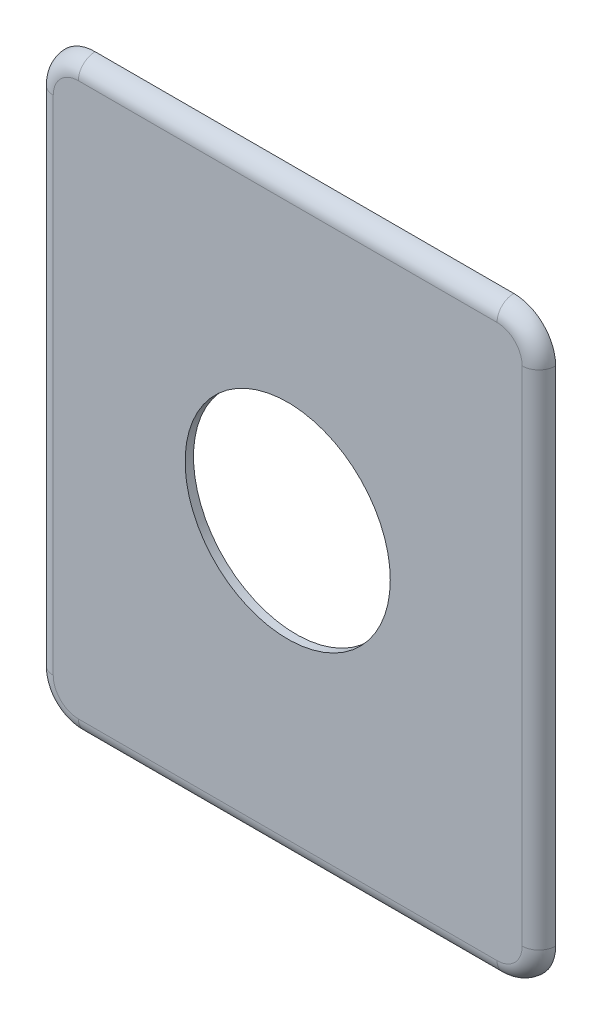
ISO-10303-21;
HEADER;
FILE_DESCRIPTION(('STEP AP214'),'2;1');
FILE_NAME('part.step','',(''),(''),'','','');
FILE_SCHEMA(('AUTOMOTIVE_DESIGN { 1 0 10303 214 1 1 1 1 }'));
ENDSEC;
DATA;
#1=APPLICATION_CONTEXT('core data for automotive mechanical design processes');
#2=APPLICATION_PROTOCOL_DEFINITION('international standard','automotive_design',2000,#1);
#3=PRODUCT_CONTEXT('',#1,'mechanical');
#4=PRODUCT('Part','Part','',(#3));
#5=PRODUCT_RELATED_PRODUCT_CATEGORY('part','',(#4));
#6=PRODUCT_DEFINITION_FORMATION('','',#4);
#7=PRODUCT_DEFINITION_CONTEXT('part definition',#1,'design');
#8=PRODUCT_DEFINITION('design','',#6,#7);
#9=PRODUCT_DEFINITION_SHAPE('','',#8);
#10=(LENGTH_UNIT() NAMED_UNIT(*) SI_UNIT(.MILLI.,.METRE.));
#11=(NAMED_UNIT(*) PLANE_ANGLE_UNIT() SI_UNIT($,.RADIAN.));
#12=(NAMED_UNIT(*) SI_UNIT($,.STERADIAN.) SOLID_ANGLE_UNIT());
#13=UNCERTAINTY_MEASURE_WITH_UNIT(LENGTH_MEASURE(1.E-05),#10,'distance_accuracy_value','');
#14=(GEOMETRIC_REPRESENTATION_CONTEXT(3) GLOBAL_UNCERTAINTY_ASSIGNED_CONTEXT((#13)) GLOBAL_UNIT_ASSIGNED_CONTEXT((#10,
#11,#12)) REPRESENTATION_CONTEXT('',''));
#15=CARTESIAN_POINT('',(0.,0.,0.));
#16=DIRECTION('',(0.,0.,1.));
#17=DIRECTION('',(1.,0.,0.));
#18=AXIS2_PLACEMENT_3D('',#15,#16,#17);
#19=CARTESIAN_POINT('',(-25.,-30.,2.));
#20=DIRECTION('',(0.,0.,-1.));
#21=DIRECTION('',(-1.,0.,0.));
#22=AXIS2_PLACEMENT_3D('',#19,#20,#21);
#23=PLANE('',#22);
#24=DIRECTION('',(-1.,0.,0.));
#25=VECTOR('',#24,1.);
#26=CARTESIAN_POINT('',(-25.,33.,2.));
#27=LINE('',#26,#25);
#28=CARTESIAN_POINT('',(25.,33.,2.));
#29=VERTEX_POINT('',#28);
#30=CARTESIAN_POINT('',(-25.,33.,2.));
#31=VERTEX_POINT('',#30);
#32=EDGE_CURVE('E50',#29,#31,#27,.T.);
#33=ORIENTED_EDGE('',*,*,#32,.T.);
#34=CARTESIAN_POINT('',(-25.,30.,2.));
#35=DIRECTION('',(0.,0.,-1.));
#36=DIRECTION('',(-1.,0.,0.));
#37=AXIS2_PLACEMENT_3D('',#34,#35,#36);
#38=CIRCLE('',#37,3.);
#39=CARTESIAN_POINT('',(-28.,30.,2.));
#40=VERTEX_POINT('',#39);
#41=EDGE_CURVE('E11',#31,#40,#38,.F.);
#42=ORIENTED_EDGE('',*,*,#41,.T.);
#43=DIRECTION('',(0.,-1.,0.));
#44=VECTOR('',#43,1.);
#45=CARTESIAN_POINT('',(-28.,-30.,2.));
#46=LINE('',#45,#44);
#47=CARTESIAN_POINT('',(-28.,-30.,2.));
#48=VERTEX_POINT('',#47);
#49=EDGE_CURVE('E153',#40,#48,#46,.T.);
#50=ORIENTED_EDGE('',*,*,#49,.T.);
#51=CARTESIAN_POINT('',(-25.,-30.,2.));
#52=DIRECTION('',(0.,0.,-1.));
#53=DIRECTION('',(-1.,0.,0.));
#54=AXIS2_PLACEMENT_3D('',#51,#52,#53);
#55=CIRCLE('',#54,3.);
#56=CARTESIAN_POINT('',(-25.,-33.,2.));
#57=VERTEX_POINT('',#56);
#58=EDGE_CURVE('E155',#48,#57,#55,.F.);
#59=ORIENTED_EDGE('',*,*,#58,.T.);
#60=DIRECTION('',(1.,0.,0.));
#61=VECTOR('',#60,1.);
#62=CARTESIAN_POINT('',(-25.,-33.,2.));
#63=LINE('',#62,#61);
#64=CARTESIAN_POINT('',(25.,-33.,2.));
#65=VERTEX_POINT('',#64);
#66=EDGE_CURVE('E121',#57,#65,#63,.T.);
#67=ORIENTED_EDGE('',*,*,#66,.T.);
#68=CARTESIAN_POINT('',(25.,-30.,2.));
#69=DIRECTION('',(0.,0.,-1.));
#70=DIRECTION('',(-1.,0.,0.));
#71=AXIS2_PLACEMENT_3D('',#68,#69,#70);
#72=CIRCLE('',#71,3.);
#73=CARTESIAN_POINT('',(28.,-30.,2.));
#74=VERTEX_POINT('',#73);
#75=EDGE_CURVE('E158',#65,#74,#72,.F.);
#76=ORIENTED_EDGE('',*,*,#75,.T.);
#77=DIRECTION('',(0.,1.,0.));
#78=VECTOR('',#77,1.);
#79=CARTESIAN_POINT('',(28.,-30.,2.));
#80=LINE('',#79,#78);
#81=CARTESIAN_POINT('',(28.,30.,2.));
#82=VERTEX_POINT('',#81);
#83=EDGE_CURVE('E160',#74,#82,#80,.T.);
#84=ORIENTED_EDGE('',*,*,#83,.T.);
#85=CARTESIAN_POINT('',(25.,30.,2.));
#86=DIRECTION('',(0.,0.,-1.));
#87=DIRECTION('',(-1.,0.,0.));
#88=AXIS2_PLACEMENT_3D('',#85,#86,#87);
#89=CIRCLE('',#88,3.);
#90=EDGE_CURVE('E61',#82,#29,#89,.F.);
#91=ORIENTED_EDGE('',*,*,#90,.T.);
#92=EDGE_LOOP('',(#33,#42,#50,#59,#67,#76,#84,#91));
#93=FACE_BOUND('',#92,.T.);
#94=CARTESIAN_POINT('',(0.,0.,2.));
#95=DIRECTION('',(0.,0.,1.));
#96=DIRECTION('',(1.,0.,0.));
#97=AXIS2_PLACEMENT_3D('',#94,#95,#96);
#98=CIRCLE('',#97,12.25);
#99=CARTESIAN_POINT('',(12.25,0.,2.));
#100=VERTEX_POINT('',#99);
#101=EDGE_CURVE('E174',#100,#100,#98,.T.);
#102=ORIENTED_EDGE('',*,*,#101,.F.);
#103=EDGE_LOOP('',(#102));
#104=FACE_BOUND('',#103,.T.);
#105=ADVANCED_FACE('F41',(#93,#104),#23,.F.);
#106=CARTESIAN_POINT('',(-25.,-30.,0.));
#107=DIRECTION('',(0.,0.,-1.));
#108=DIRECTION('',(-1.,0.,0.));
#109=AXIS2_PLACEMENT_3D('',#106,#107,#108);
#110=PLANE('',#109);
#111=CARTESIAN_POINT('',(0.,0.,0.));
#112=DIRECTION('',(0.,0.,1.));
#113=DIRECTION('',(1.,0.,0.));
#114=AXIS2_PLACEMENT_3D('',#111,#112,#113);
#115=CIRCLE('',#114,14.25);
#116=CARTESIAN_POINT('',(14.25,0.,0.));
#117=VERTEX_POINT('',#116);
#118=EDGE_CURVE('E131',#117,#117,#115,.T.);
#119=ORIENTED_EDGE('',*,*,#118,.T.);
#120=EDGE_LOOP('',(#119));
#121=FACE_BOUND('',#120,.T.);
#122=CARTESIAN_POINT('',(-25.,-30.,0.));
#123=DIRECTION('',(0.,0.,1.));
#124=DIRECTION('',(-1.,0.,0.));
#125=AXIS2_PLACEMENT_3D('',#122,#123,#124);
#126=CIRCLE('',#125,5.);
#127=CARTESIAN_POINT('',(-30.,-30.,0.));
#128=VERTEX_POINT('',#127);
#129=CARTESIAN_POINT('',(-25.,-35.,0.));
#130=VERTEX_POINT('',#129);
#131=EDGE_CURVE('E109',#128,#130,#126,.T.);
#132=ORIENTED_EDGE('',*,*,#131,.F.);
#133=DIRECTION('',(0.,-1.,0.));
#134=VECTOR('',#133,1.);
#135=CARTESIAN_POINT('',(-30.,-30.,0.));
#136=LINE('',#135,#134);
#137=CARTESIAN_POINT('',(-30.,30.,0.));
#138=VERTEX_POINT('',#137);
#139=EDGE_CURVE('E151',#138,#128,#136,.T.);
#140=ORIENTED_EDGE('',*,*,#139,.F.);
#141=CARTESIAN_POINT('',(-25.,30.,0.));
#142=DIRECTION('',(0.,0.,1.));
#143=DIRECTION('',(-1.,0.,0.));
#144=AXIS2_PLACEMENT_3D('',#141,#142,#143);
#145=CIRCLE('',#144,5.);
#146=CARTESIAN_POINT('',(-25.,35.,0.));
#147=VERTEX_POINT('',#146);
#148=EDGE_CURVE('E148',#147,#138,#145,.T.);
#149=ORIENTED_EDGE('',*,*,#148,.F.);
#150=DIRECTION('',(-1.,0.,0.));
#151=VECTOR('',#150,1.);
#152=CARTESIAN_POINT('',(-25.,35.,0.));
#153=LINE('',#152,#151);
#154=CARTESIAN_POINT('',(25.,35.,0.));
#155=VERTEX_POINT('',#154);
#156=EDGE_CURVE('E145',#155,#147,#153,.T.);
#157=ORIENTED_EDGE('',*,*,#156,.F.);
#158=CARTESIAN_POINT('',(25.,30.,0.));
#159=DIRECTION('',(0.,0.,1.));
#160=DIRECTION('',(-1.,0.,0.));
#161=AXIS2_PLACEMENT_3D('',#158,#159,#160);
#162=CIRCLE('',#161,5.);
#163=CARTESIAN_POINT('',(30.,30.,0.));
#164=VERTEX_POINT('',#163);
#165=EDGE_CURVE('E142',#164,#155,#162,.T.);
#166=ORIENTED_EDGE('',*,*,#165,.F.);
#167=DIRECTION('',(0.,1.,0.));
#168=VECTOR('',#167,1.);
#169=CARTESIAN_POINT('',(30.,-30.,0.));
#170=LINE('',#169,#168);
#171=CARTESIAN_POINT('',(30.,-30.,0.));
#172=VERTEX_POINT('',#171);
#173=EDGE_CURVE('E139',#172,#164,#170,.T.);
#174=ORIENTED_EDGE('',*,*,#173,.F.);
#175=CARTESIAN_POINT('',(25.,-30.,0.));
#176=DIRECTION('',(0.,0.,1.));
#177=DIRECTION('',(1.,0.,0.));
#178=AXIS2_PLACEMENT_3D('',#175,#176,#177);
#179=CIRCLE('',#178,5.);
#180=CARTESIAN_POINT('',(25.,-35.,0.));
#181=VERTEX_POINT('',#180);
#182=EDGE_CURVE('E112',#181,#172,#179,.T.);
#183=ORIENTED_EDGE('',*,*,#182,.F.);
#184=DIRECTION('',(1.,0.,0.));
#185=VECTOR('',#184,1.);
#186=CARTESIAN_POINT('',(-25.,-35.,0.));
#187=LINE('',#186,#185);
#188=EDGE_CURVE('E105',#130,#181,#187,.T.);
#189=ORIENTED_EDGE('',*,*,#188,.F.);
#190=EDGE_LOOP('',(#132,#140,#149,#157,#166,#174,#183,#189));
#191=FACE_BOUND('',#190,.T.);
#192=ADVANCED_FACE('F107',(#121,#191),#110,.T.);
#193=CARTESIAN_POINT('',(0.,0.,2.));
#194=DIRECTION('',(0.,0.,1.));
#195=DIRECTION('',(1.,0.,0.));
#196=AXIS2_PLACEMENT_3D('',#193,#194,#195);
#197=CYLINDRICAL_SURFACE('',#196,14.25);
#198=ORIENTED_EDGE('',*,*,#118,.F.);
#199=EDGE_LOOP('',(#198));
#200=FACE_BOUND('',#199,.T.);
#201=CARTESIAN_POINT('',(0.,0.,1.));
#202=DIRECTION('',(0.,0.,1.));
#203=DIRECTION('',(1.,0.,0.));
#204=AXIS2_PLACEMENT_3D('',#201,#202,#203);
#205=CIRCLE('',#204,14.25);
#206=CARTESIAN_POINT('',(14.25,0.,1.));
#207=VERTEX_POINT('',#206);
#208=EDGE_CURVE('E134',#207,#207,#205,.T.);
#209=ORIENTED_EDGE('',*,*,#208,.T.);
#210=EDGE_LOOP('',(#209));
#211=FACE_BOUND('',#210,.T.);
#212=ADVANCED_FACE('F188',(#200,#211),#197,.F.);
#213=CARTESIAN_POINT('',(12.25,0.,1.));
#214=DIRECTION('',(0.,0.,1.));
#215=DIRECTION('',(1.,0.,0.));
#216=AXIS2_PLACEMENT_3D('',#213,#214,#215);
#217=PLANE('',#216);
#218=ORIENTED_EDGE('',*,*,#208,.F.);
#219=EDGE_LOOP('',(#218));
#220=FACE_BOUND('',#219,.T.);
#221=CARTESIAN_POINT('',(0.,0.,1.));
#222=DIRECTION('',(0.,0.,1.));
#223=DIRECTION('',(1.,0.,0.));
#224=AXIS2_PLACEMENT_3D('',#221,#222,#223);
#225=CIRCLE('',#224,12.25);
#226=CARTESIAN_POINT('',(12.25,0.,1.));
#227=VERTEX_POINT('',#226);
#228=EDGE_CURVE('E179',#227,#227,#225,.T.);
#229=ORIENTED_EDGE('',*,*,#228,.T.);
#230=EDGE_LOOP('',(#229));
#231=FACE_BOUND('',#230,.T.);
#232=ADVANCED_FACE('F190',(#220,#231),#217,.F.);
#233=CARTESIAN_POINT('',(0.,0.,2.));
#234=DIRECTION('',(0.,0.,1.));
#235=DIRECTION('',(1.,0.,0.));
#236=AXIS2_PLACEMENT_3D('',#233,#234,#235);
#237=CYLINDRICAL_SURFACE('',#236,12.25);
#238=ORIENTED_EDGE('',*,*,#228,.F.);
#239=EDGE_LOOP('',(#238));
#240=FACE_BOUND('',#239,.T.);
#241=ORIENTED_EDGE('',*,*,#101,.T.);
#242=EDGE_LOOP('',(#241));
#243=FACE_BOUND('',#242,.T.);
#244=ADVANCED_FACE('F193',(#240,#243),#237,.F.);
#245=CARTESIAN_POINT('',(25.,-30.,0.));
#246=DIRECTION('',(0.,0.,-1.));
#247=DIRECTION('',(-1.,0.,0.));
#248=AXIS2_PLACEMENT_3D('',#245,#246,#247);
#249=TOROIDAL_SURFACE('',#248,3.,2.);
#250=CARTESIAN_POINT('',(25.,-33.,0.));
#251=DIRECTION('',(-1.,0.,0.));
#252=DIRECTION('',(0.,0.,1.));
#253=AXIS2_PLACEMENT_3D('',#250,#251,#252);
#254=CIRCLE('',#253,2.);
#255=EDGE_CURVE('E172',#181,#65,#254,.T.);
#256=ORIENTED_EDGE('',*,*,#255,.F.);
#257=ORIENTED_EDGE('',*,*,#182,.T.);
#258=CARTESIAN_POINT('',(28.,-30.,0.));
#259=DIRECTION('',(0.,1.,0.));
#260=DIRECTION('',(0.,0.,1.));
#261=AXIS2_PLACEMENT_3D('',#258,#259,#260);
#262=CIRCLE('',#261,2.);
#263=EDGE_CURVE('E45',#74,#172,#262,.T.);
#264=ORIENTED_EDGE('',*,*,#263,.F.);
#265=ORIENTED_EDGE('',*,*,#75,.F.);
#266=EDGE_LOOP('',(#256,#257,#264,#265));
#267=FACE_BOUND('',#266,.T.);
#268=ADVANCED_FACE('F43',(#267),#249,.T.);
#269=CARTESIAN_POINT('',(28.,-30.,0.));
#270=DIRECTION('',(0.,1.,0.));
#271=DIRECTION('',(0.,0.,1.));
#272=AXIS2_PLACEMENT_3D('',#269,#270,#271);
#273=CYLINDRICAL_SURFACE('',#272,2.);
#274=ORIENTED_EDGE('',*,*,#263,.T.);
#275=ORIENTED_EDGE('',*,*,#173,.T.);
#276=CARTESIAN_POINT('',(28.,30.,0.));
#277=DIRECTION('',(0.,1.,0.));
#278=DIRECTION('',(0.,0.,1.));
#279=AXIS2_PLACEMENT_3D('',#276,#277,#278);
#280=CIRCLE('',#279,2.);
#281=EDGE_CURVE('E124',#82,#164,#280,.T.);
#282=ORIENTED_EDGE('',*,*,#281,.F.);
#283=ORIENTED_EDGE('',*,*,#83,.F.);
#284=EDGE_LOOP('',(#274,#275,#282,#283));
#285=FACE_BOUND('',#284,.T.);
#286=ADVANCED_FACE('F203',(#285),#273,.T.);
#287=CARTESIAN_POINT('',(-25.,-33.,0.));
#288=DIRECTION('',(1.,0.,0.));
#289=DIRECTION('',(0.,0.,-1.));
#290=AXIS2_PLACEMENT_3D('',#287,#288,#289);
#291=CYLINDRICAL_SURFACE('',#290,2.);
#292=ORIENTED_EDGE('',*,*,#255,.T.);
#293=ORIENTED_EDGE('',*,*,#66,.F.);
#294=CARTESIAN_POINT('',(-25.,-33.,0.));
#295=DIRECTION('',(-1.,0.,0.));
#296=DIRECTION('',(0.,0.,1.));
#297=AXIS2_PLACEMENT_3D('',#294,#295,#296);
#298=CIRCLE('',#297,2.);
#299=EDGE_CURVE('E119',#130,#57,#298,.T.);
#300=ORIENTED_EDGE('',*,*,#299,.F.);
#301=ORIENTED_EDGE('',*,*,#188,.T.);
#302=EDGE_LOOP('',(#292,#293,#300,#301));
#303=FACE_BOUND('',#302,.T.);
#304=ADVANCED_FACE('F120',(#303),#291,.T.);
#305=CARTESIAN_POINT('',(25.,30.,0.));
#306=DIRECTION('',(0.,0.,-1.));
#307=DIRECTION('',(-1.,0.,0.));
#308=AXIS2_PLACEMENT_3D('',#305,#306,#307);
#309=TOROIDAL_SURFACE('',#308,3.,2.);
#310=ORIENTED_EDGE('',*,*,#281,.T.);
#311=ORIENTED_EDGE('',*,*,#165,.T.);
#312=CARTESIAN_POINT('',(25.,33.,0.));
#313=DIRECTION('',(-1.,0.,0.));
#314=DIRECTION('',(0.,0.,1.));
#315=AXIS2_PLACEMENT_3D('',#312,#313,#314);
#316=CIRCLE('',#315,2.);
#317=EDGE_CURVE('E125',#29,#155,#316,.T.);
#318=ORIENTED_EDGE('',*,*,#317,.F.);
#319=ORIENTED_EDGE('',*,*,#90,.F.);
#320=EDGE_LOOP('',(#310,#311,#318,#319));
#321=FACE_BOUND('',#320,.T.);
#322=ADVANCED_FACE('F228',(#321),#309,.T.);
#323=CARTESIAN_POINT('',(-25.,-30.,0.));
#324=DIRECTION('',(0.,0.,-1.));
#325=DIRECTION('',(-1.,0.,0.));
#326=AXIS2_PLACEMENT_3D('',#323,#324,#325);
#327=TOROIDAL_SURFACE('',#326,3.,2.);
#328=ORIENTED_EDGE('',*,*,#299,.T.);
#329=ORIENTED_EDGE('',*,*,#58,.F.);
#330=CARTESIAN_POINT('',(-28.,-30.,0.));
#331=DIRECTION('',(0.,1.,0.));
#332=DIRECTION('',(0.,0.,1.));
#333=AXIS2_PLACEMENT_3D('',#330,#331,#332);
#334=CIRCLE('',#333,2.);
#335=EDGE_CURVE('E129',#128,#48,#334,.T.);
#336=ORIENTED_EDGE('',*,*,#335,.F.);
#337=ORIENTED_EDGE('',*,*,#131,.T.);
#338=EDGE_LOOP('',(#328,#329,#336,#337));
#339=FACE_BOUND('',#338,.T.);
#340=ADVANCED_FACE('F127',(#339),#327,.T.);
#341=CARTESIAN_POINT('',(-25.,33.,0.));
#342=DIRECTION('',(-1.,0.,0.));
#343=DIRECTION('',(0.,0.,1.));
#344=AXIS2_PLACEMENT_3D('',#341,#342,#343);
#345=CYLINDRICAL_SURFACE('',#344,2.);
#346=ORIENTED_EDGE('',*,*,#317,.T.);
#347=ORIENTED_EDGE('',*,*,#156,.T.);
#348=CARTESIAN_POINT('',(-25.,33.,0.));
#349=DIRECTION('',(-1.,0.,0.));
#350=DIRECTION('',(0.,0.,1.));
#351=AXIS2_PLACEMENT_3D('',#348,#349,#350);
#352=CIRCLE('',#351,2.);
#353=EDGE_CURVE('E166',#31,#147,#352,.T.);
#354=ORIENTED_EDGE('',*,*,#353,.F.);
#355=ORIENTED_EDGE('',*,*,#32,.F.);
#356=EDGE_LOOP('',(#346,#347,#354,#355));
#357=FACE_BOUND('',#356,.T.);
#358=ADVANCED_FACE('F221',(#357),#345,.T.);
#359=CARTESIAN_POINT('',(-28.,-30.,0.));
#360=DIRECTION('',(0.,-1.,0.));
#361=DIRECTION('',(0.,0.,-1.));
#362=AXIS2_PLACEMENT_3D('',#359,#360,#361);
#363=CYLINDRICAL_SURFACE('',#362,2.);
#364=ORIENTED_EDGE('',*,*,#335,.T.);
#365=ORIENTED_EDGE('',*,*,#49,.F.);
#366=CARTESIAN_POINT('',(-28.,30.,0.));
#367=DIRECTION('',(0.,1.,0.));
#368=DIRECTION('',(0.,0.,1.));
#369=AXIS2_PLACEMENT_3D('',#366,#367,#368);
#370=CIRCLE('',#369,2.);
#371=EDGE_CURVE('E164',#138,#40,#370,.T.);
#372=ORIENTED_EDGE('',*,*,#371,.F.);
#373=ORIENTED_EDGE('',*,*,#139,.T.);
#374=EDGE_LOOP('',(#364,#365,#372,#373));
#375=FACE_BOUND('',#374,.T.);
#376=ADVANCED_FACE('F217',(#375),#363,.T.);
#377=CARTESIAN_POINT('',(-25.,30.,0.));
#378=DIRECTION('',(0.,0.,-1.));
#379=DIRECTION('',(-1.,0.,0.));
#380=AXIS2_PLACEMENT_3D('',#377,#378,#379);
#381=TOROIDAL_SURFACE('',#380,3.,2.);
#382=ORIENTED_EDGE('',*,*,#353,.T.);
#383=ORIENTED_EDGE('',*,*,#148,.T.);
#384=ORIENTED_EDGE('',*,*,#371,.T.);
#385=ORIENTED_EDGE('',*,*,#41,.F.);
#386=EDGE_LOOP('',(#382,#383,#384,#385));
#387=FACE_BOUND('',#386,.T.);
#388=ADVANCED_FACE('F214',(#387),#381,.T.);
#389=CLOSED_SHELL('',(#105,#192,#212,#232,#244,#268,#286,#304,#322,#340,#358,#376,#388));
#390=MANIFOLD_SOLID_BREP('B2',#389);
#391=ADVANCED_BREP_SHAPE_REPRESENTATION('',(#18,#390),#14);
#392=SHAPE_DEFINITION_REPRESENTATION(#9,#391);
ENDSEC;
END-ISO-10303-21;
